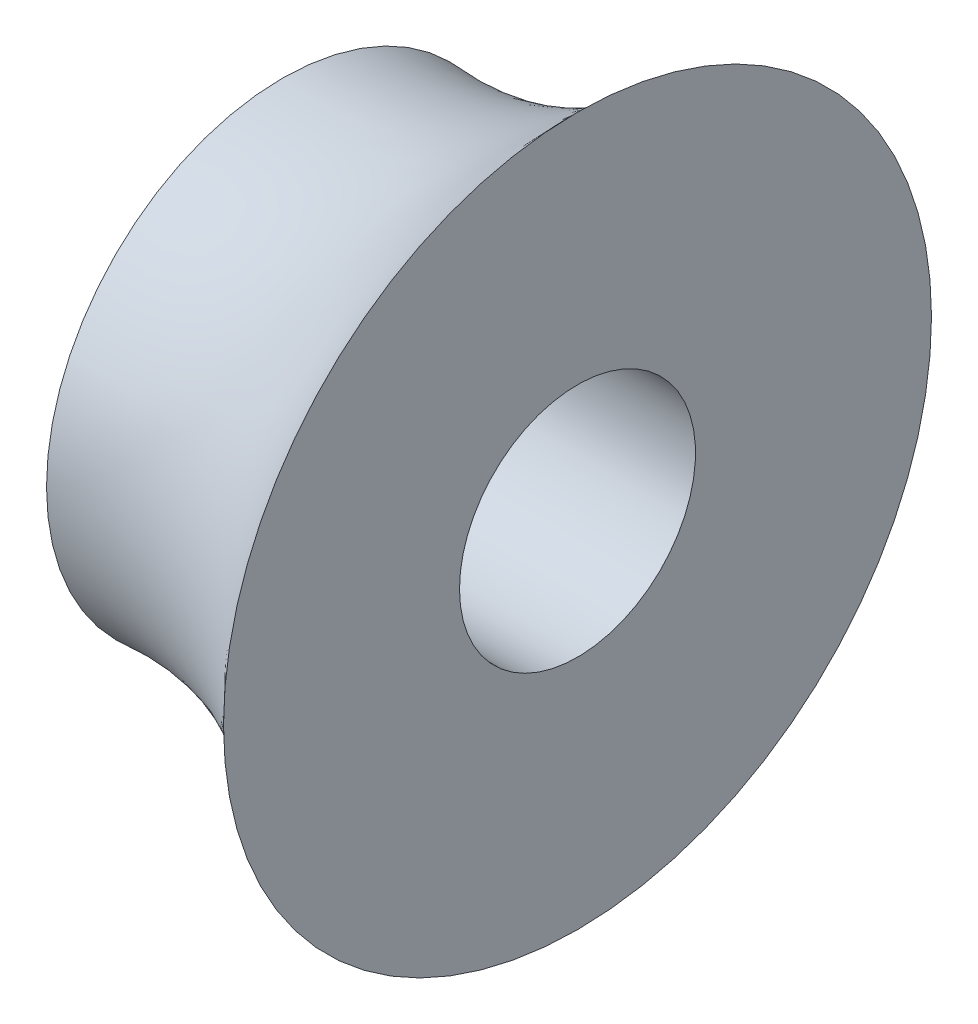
from build123d import *


with BuildPart() as part:
    # Esquisse1 → Base-R_volution (revolve)
    with BuildSketch(Plane(origin=(0, 0, 0), x_dir=(1, 0, 0), z_dir=(0, 1, 0)), mode=Mode.PRIVATE) as base_r_volution_sk:
        with BuildLine():
            Line((0, 0.2), (0, 0.6))
            ThreePointArc((0, 0.6), (-0.226301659, 0.440754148), (-0.5, 0.4))
            Line((-0.5, 0.4), (-0.5, 0.2))
            Line((-0.5, 0.2), (0, 0.2))
        make_face()
    revolve(base_r_volution_sk.sketch.rotate(Axis((-1.136946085, 0, 0), (1, 0, 0)), 180), axis=Axis((-1.136946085, 0, 0), (1, 0, 0)))


solid = part.part
